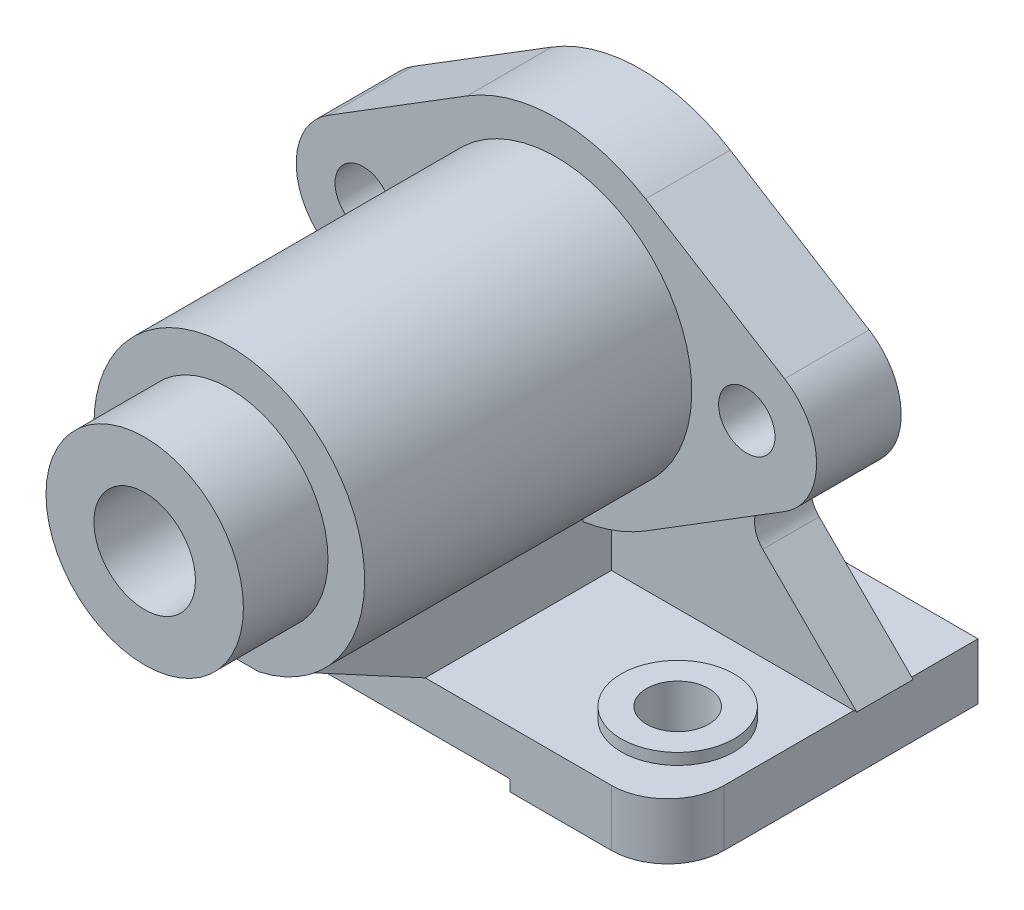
from build123d import *

# Parameters (mm, degrees)
EXTRUDE_1_DEPTH      = 55
SKETCH_2_R           = 10
EXTRUDE_2_DEPTH      = 2
SKETCH_3_R           = 5.5
CUT_EXTRUDE_1_DEPTH  = 115.82249682
EXTRUDE_3_DEPTH      = 22
CUT_EXTRUDE_8_DEPTH  = 115
EXTRUDE_4_DEPTH      = 5
SKETCH_20_R          = 24
EXTRUDE_5_DEPTH      = 2
EXTRUDE_START        = 58
SKETCH_21_R          = 24
EXTRUDE_6_DEPTH      = 58
SKETCH_22_R          = 17.5
EXTRUDE_7_DEPTH      = 15
EXTRUDE_9_DEPTH      = 85
CUT_EXTRUDE_9_DEPTH  = 63
CUT_EXTRUDE_10_DEPTH = 63
SKETCH_26_R          = 21
CUT_EXTRUDE_11_DEPTH = 12
SKETCH_27_R          = 18
CUT_EXTRUDE_12_DEPTH = 56
SKETCH_29_R          = 9
CUT_EXTRUDE_13_DEPTH = 56
CHAMFER_1_SIZE       = 1
CUT_EXTRUDE_14_DEPTH = 56
SKETCH_31_R          = 5
CUT_EXTRUDE_15_DEPTH = 30


with BuildPart() as part:
    # Sketch 1 → Extrude 1 (new body)
    with BuildSketch(Plane.XY):
        Polygon((-100.076, -48.514), (-72.076, -48.514), (-72.076, -46.514), (-32.076, -46.514), (-32.076, -48.514), (-4.076, -48.514), (-4.076, -38.514), (-100.076, -38.514), align=None)
    extrude(amount=EXTRUDE_1_DEPTH)

    # Sketch 2 → Extrude 2 (add)
    with BuildSketch(Plane(origin=(0, -38.514, 0), x_dir=(-1, 0, 0), z_dir=(0, 1, 0))):
        with Locations(Location((18.330545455, 39, 0), (0, 0, 180))):
            Circle(SKETCH_2_R)
        with Locations(Location((86.330545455, 39, 0), (0, 0, 180))):
            Circle(SKETCH_2_R)
    extrude(amount=EXTRUDE_2_DEPTH)

    # Sketch 3 → Cut-Extrude 1 (cut, through all)
    with BuildSketch(Plane(origin=(0, -36.514, 0), x_dir=(-1, 0, 0), z_dir=(0, 1, 0))):
        with Locations((18.330545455, 39)):
            Circle(SKETCH_3_R)
        with Locations((86.330545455, 39)):
            Circle(SKETCH_3_R)
    extrude(amount=-CUT_EXTRUDE_1_DEPTH, mode=Mode.SUBTRACT)

    # Sketch 4 → Extrude 3 (add)
    with BuildSketch(Plane(origin=(0, 0, 0), x_dir=(-1, 0, 0), z_dir=(0, 0, -1))):
        with BuildLine():
            Line((3.577153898, -38.514), (100.076, -38.514))
            Line((100.076, -38.514), (83.41298942, -21.85098942))
            ThreePointArc((83.41298942, -21.85098942), (81.981534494, -17.742013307), (84.311677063, -14.067345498))
            Line((84.311677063, -14.067345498), (92.286783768, -9.117219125))
            ThreePointArc((92.286783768, -9.117219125), (97.958373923, 1.078428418), (92.286783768, 11.274075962))
            Line((92.286783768, 11.274075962), (67.647601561, 26.567547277))
            ThreePointArc((67.647601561, 26.567547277), (51.826576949, 31.078428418), (36.005552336, 26.567547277))
            Line((36.005552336, 26.567547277), (11.36637013, 11.274075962))
            ThreePointArc((11.36637013, 11.274075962), (5.694779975, 1.078428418), (11.36637013, -9.117219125))
            Line((11.36637013, -9.117219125), (19.341476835, -14.067345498))
            ThreePointArc((19.341476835, -14.067345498), (21.671619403, -17.742013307), (20.240164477, -21.85098942))
            Line((20.240164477, -21.85098942), (3.577153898, -38.514))
        make_face()
    extrude(amount=-EXTRUDE_3_DEPTH)

    # Sketch 18 → Cut-Extrude 8 (cut)
    with BuildSketch(Plane(origin=(0, 0, 0), x_dir=(0, 0, -1), z_dir=(1, 0, 0))):
        Polygon((1.423784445, 32.803070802), (1.423784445, 31.078428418), (1.423784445, -38.514), (-12, -38.514), (-12, 30.897016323), (-12, 32.803070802), align=None)
    extrude(amount=-CUT_EXTRUDE_8_DEPTH, mode=Mode.SUBTRACT)

    # Sketch 19 → Extrude 4 (add)
    with BuildSketch(Plane.XY.offset(22)):
        with BuildLine():
            Line((-92.286783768, 11.274075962), (-67.647601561, 26.567547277))
            ThreePointArc((-67.647601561, 26.567547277), (-51.826576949, 31.078428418), (-36.005552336, 26.567547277))
            Line((-36.005552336, 26.567547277), (-11.36637013, 11.274075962))
            ThreePointArc((-11.36637013, 11.274075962), (-5.694779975, 1.078428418), (-11.36637013, -9.117219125))
            Line((-11.36637013, -9.117219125), (-36.005552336, -24.410690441))
            ThreePointArc((-36.005552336, -24.410690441), (-51.826576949, -28.921571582), (-67.647601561, -24.410690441))
            Line((-67.647601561, -24.410690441), (-92.286783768, -9.117219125))
            ThreePointArc((-92.286783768, -9.117219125), (-97.958373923, 1.078428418), (-92.286783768, 11.274075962))
        make_face()
    extrude(amount=EXTRUDE_4_DEPTH)

    # Sketch 20 → Extrude 5 (add)
    with BuildSketch(Plane(origin=(0, 0, 12), x_dir=(-1, 0, 0), z_dir=(0, 0, -1))):
        with Locations((51.826576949, 1.078428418)):
            Circle(SKETCH_20_R)
    extrude(amount=EXTRUDE_5_DEPTH)

    # Sketch 21 → Extrude 6 (add)
    with BuildSketch(Plane.XY.offset(27).offset(EXTRUDE_START)):
        with Locations((-51.826576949, 1.078428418)):
            Circle(SKETCH_21_R)
    extrude(amount=-EXTRUDE_6_DEPTH)

    # Sketch 22 → Extrude 7 (add)
    with BuildSketch(Plane.XY.offset(85)):
        with Locations((-51.826576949, 1.078428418)):
            Circle(SKETCH_22_R)
    extrude(amount=EXTRUDE_7_DEPTH)

    # Sketch 23 → Extrude 9 (add)
    with BuildSketch(Plane.XY.offset(85)):
        with BuildLine():
            Line((-57.076, -22.340443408), (-57.076, -38.514))
            Line((-57.076, -38.514), (-47.076, -38.514))
            Line((-47.076, -38.514), (-47.076, -22.446707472))
            ThreePointArc((-47.076, -22.446707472), (-52.081596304, -22.92021665), (-57.076, -22.340443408))
        make_face()
    extrude(amount=-EXTRUDE_9_DEPTH)

    # Sketch 24 → Cut-Extrude 9 (cut)
    with BuildSketch(Plane.ZY.offset(57.076)):
        Polygon((85, -22.340443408), (55, -38.514), (85, -38.514), align=None)
    extrude(amount=-CUT_EXTRUDE_9_DEPTH, mode=Mode.SUBTRACT)

    # Sketch 25 → Cut-Extrude 10 (cut)
    with BuildSketch(Plane.ZY.offset(57.076)):
        Polygon((10, -22.340443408), (0, -38.514), (0, -22.340443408), align=None)
    extrude(amount=-CUT_EXTRUDE_10_DEPTH, mode=Mode.SUBTRACT)

    # Sketch 26 → Cut-Extrude 11 (cut)
    with BuildSketch(Plane(origin=(0, 0, 10), x_dir=(-1, 0, 0), z_dir=(0, 0, -1))):
        with Locations((51.826576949, 1.078428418)):
            Circle(SKETCH_26_R)
    extrude(amount=-CUT_EXTRUDE_11_DEPTH, mode=Mode.SUBTRACT)

    # Sketch 27 → Cut-Extrude 12 (cut)
    with BuildSketch(Plane(origin=(0, 0, 22), x_dir=(-1, 0, 0), z_dir=(0, 0, -1))):
        with Locations((51.826576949, 1.078428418)):
            Circle(SKETCH_27_R)
    extrude(amount=-CUT_EXTRUDE_12_DEPTH, mode=Mode.SUBTRACT)

    # Sketch 29 → Cut-Extrude 13 (cut)
    with BuildSketch(Plane.XY.offset(100)):
        with Locations((-51.826576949, 1.078428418)):
            Circle(SKETCH_29_R)
    extrude(amount=-CUT_EXTRUDE_13_DEPTH, mode=Mode.SUBTRACT)

    # Chamfer 1
    chamfer_1_edges = [part.edges().sort_by_distance(p)[0] for p in [
        (-30.826576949, 1.078428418, 10),
    ]]
    chamfer(chamfer_1_edges, length=CHAMFER_1_SIZE)

    # Sketch 30 → Cut-Extrude 14 (cut)
    with BuildSketch(Plane(origin=(0, -38.514, 0), x_dir=(-1, 0, 0), z_dir=(0, 1, 0))):
        with BuildLine():
            Line((100.076, 55), (90.076, 55))
            ThreePointArc((90.076, 55), (97.147067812, 52.071067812), (100.076, 45))
            Line((100.076, 45), (100.076, 55))
        make_face()
        with BuildLine():
            Line((4.076, 55), (14.076, 55))
            ThreePointArc((14.076, 55), (7.004932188, 52.071067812), (4.076, 45))
            Line((4.076, 45), (4.076, 55))
        make_face()
    extrude(amount=-CUT_EXTRUDE_14_DEPTH, mode=Mode.SUBTRACT)

    # Sketch 31 → Cut-Extrude 15 (cut)
    with BuildSketch(Plane(origin=(0, 0, 12), x_dir=(-1, 0, 0), z_dir=(0, 0, -1))):
        with Locations((86.076, 1.486)):
            Circle(SKETCH_31_R)
        with Locations(Location((18.076, 1.486, 0), (0, 0, 180))):
            Circle(SKETCH_31_R)
    extrude(amount=-CUT_EXTRUDE_15_DEPTH, mode=Mode.SUBTRACT)


solid = part.part
